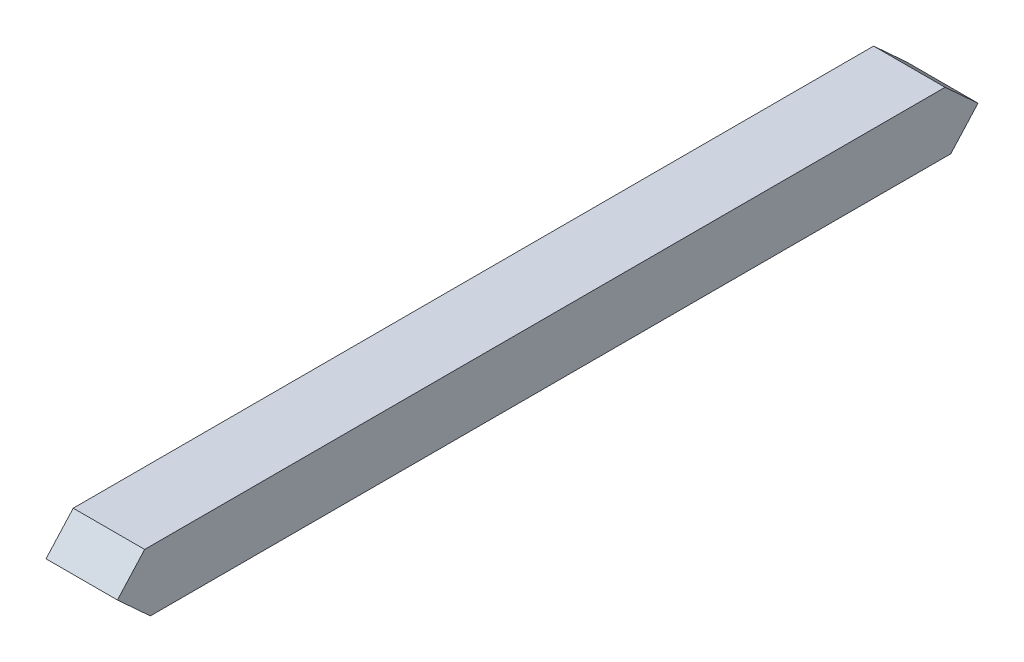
from build123d import *

# Parameters (mm, degrees)
ESQUISSE1_W                  = 65
ESQUISSE1_H                  = 55
BOSS_EXTRU_1_DEPTH           = 783
ENL_V_MAT_EXTRU_1_DEPTH      = 785.156553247
ENL_V_MAT_EXTRU_1_DEPTH_BACK = 785.156553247


with BuildPart() as part:
    # Esquisse1 → Boss.-Extru.1 (new body)
    with BuildSketch(Plane.XY):
        Rectangle(ESQUISSE1_W, ESQUISSE1_H)
    extrude(amount=BOSS_EXTRU_1_DEPTH)

    # Esquisse3 → Enl_v. mat.-Extru.1 (cut, two sides: drawn at the far end of the back side and taken through both)
    with BuildSketch(Plane(origin=(0, 0, 0), x_dir=(0, 0, -1), z_dir=(1, 0, 0)).offset(-ENL_V_MAT_EXTRU_1_DEPTH_BACK)):
        Polygon((-753.042865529, -27.5), (-783, 0), (-783, -27.5), align=None)
        Polygon((-783, 27.5), (-783, 0), (-758.227080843, 27.5), align=None)
        Polygon((0, 0), (-24.772919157, -27.5), (0, -27.5), align=None)
        Polygon((-29.957134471, 27.5), (0, 0), (0, 27.5), align=None)
    extrude(amount=ENL_V_MAT_EXTRU_1_DEPTH + ENL_V_MAT_EXTRU_1_DEPTH_BACK, mode=Mode.SUBTRACT)


solid = part.part
